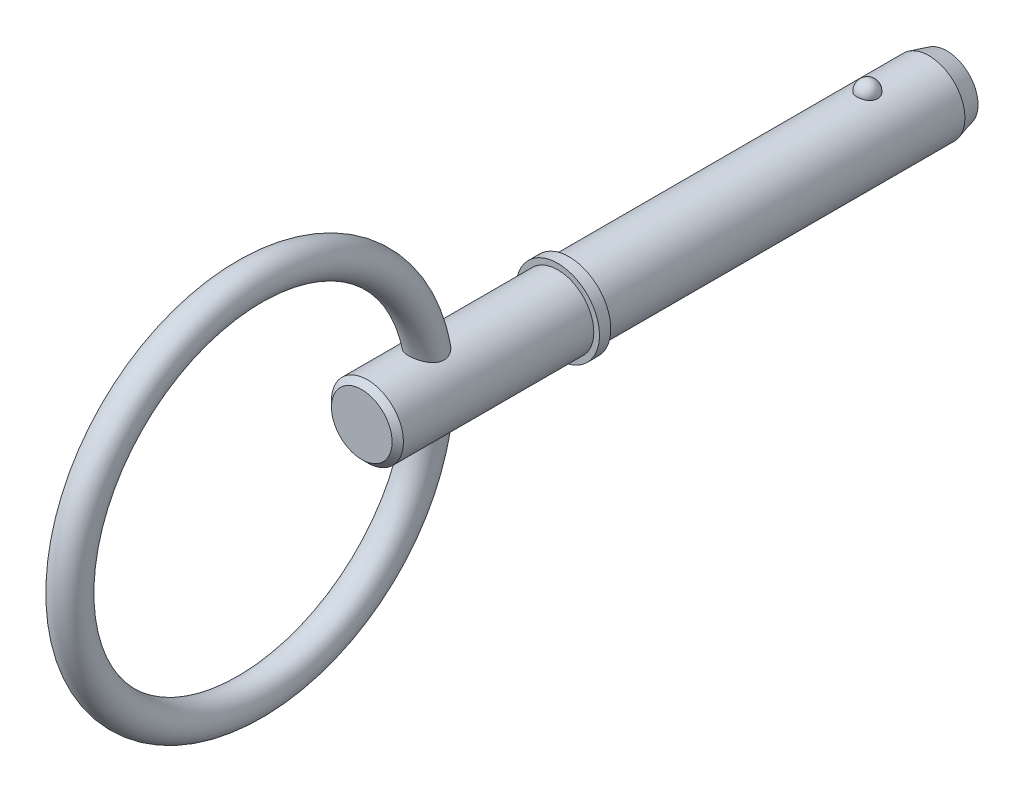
ISO-10303-21;
HEADER;
FILE_DESCRIPTION(('STEP AP214'),'2;1');
FILE_NAME('part.step','',(''),(''),'','','');
FILE_SCHEMA(('AUTOMOTIVE_DESIGN { 1 0 10303 214 1 1 1 1 }'));
ENDSEC;
DATA;
#1=APPLICATION_CONTEXT('core data for automotive mechanical design processes');
#2=APPLICATION_PROTOCOL_DEFINITION('international standard','automotive_design',2000,#1);
#3=PRODUCT_CONTEXT('',#1,'mechanical');
#4=PRODUCT('Part','Part','',(#3));
#5=PRODUCT_RELATED_PRODUCT_CATEGORY('part','',(#4));
#6=PRODUCT_DEFINITION_FORMATION('','',#4);
#7=PRODUCT_DEFINITION_CONTEXT('part definition',#1,'design');
#8=PRODUCT_DEFINITION('design','',#6,#7);
#9=PRODUCT_DEFINITION_SHAPE('','',#8);
#10=(LENGTH_UNIT() NAMED_UNIT(*) SI_UNIT(.MILLI.,.METRE.));
#11=(NAMED_UNIT(*) PLANE_ANGLE_UNIT() SI_UNIT($,.RADIAN.));
#12=(NAMED_UNIT(*) SI_UNIT($,.STERADIAN.) SOLID_ANGLE_UNIT());
#13=UNCERTAINTY_MEASURE_WITH_UNIT(LENGTH_MEASURE(1.E-05),#10,'distance_accuracy_value','');
#14=(GEOMETRIC_REPRESENTATION_CONTEXT(3) GLOBAL_UNCERTAINTY_ASSIGNED_CONTEXT((#13)) GLOBAL_UNIT_ASSIGNED_CONTEXT((#10,
#11,#12)) REPRESENTATION_CONTEXT('',''));
#15=CARTESIAN_POINT('',(0.,0.,0.));
#16=DIRECTION('',(0.,0.,1.));
#17=DIRECTION('',(1.,0.,0.));
#18=AXIS2_PLACEMENT_3D('',#15,#16,#17);
#19=CARTESIAN_POINT('',(0.,0.,25.4));
#20=DIRECTION('',(0.,0.,-1.));
#21=DIRECTION('',(-1.,0.,0.));
#22=AXIS2_PLACEMENT_3D('',#19,#20,#21);
#23=CYLINDRICAL_SURFACE('',#22,3.175);
#24=CARTESIAN_POINT('',(0.90060722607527,3.0445905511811,-0.910000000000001));
#25=CARTESIAN_POINT('',(0.90060646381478,3.04459122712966,-0.859144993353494));
#26=CARTESIAN_POINT('',(0.896466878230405,3.04582460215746,-0.808280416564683));
#27=CARTESIAN_POINT('',(0.88000740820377,3.05062019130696,-0.707994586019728));
#28=CARTESIAN_POINT('',(0.86768478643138,3.05418318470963,-0.658573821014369));
#29=CARTESIAN_POINT('',(0.835170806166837,3.06323316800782,-0.562604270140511));
#30=CARTESIAN_POINT('',(0.814982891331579,3.0687193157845,-0.516054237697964));
#31=CARTESIAN_POINT('',(0.767236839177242,3.08100268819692,-0.427093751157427));
#32=CARTESIAN_POINT('',(0.739678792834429,3.08779989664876,-0.384683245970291));
#33=CARTESIAN_POINT('',(0.677715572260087,3.10198953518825,-0.304951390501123));
#34=CARTESIAN_POINT('',(0.643275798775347,3.10938485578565,-0.267657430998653));
#35=CARTESIAN_POINT('',(0.568522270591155,3.12391647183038,-0.199446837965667));
#36=CARTESIAN_POINT('',(0.528208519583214,3.13105276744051,-0.168530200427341));
#37=CARTESIAN_POINT('',(0.442911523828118,3.14425008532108,-0.114021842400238));
#38=CARTESIAN_POINT('',(0.397942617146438,3.15031426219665,-0.0904084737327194));
#39=CARTESIAN_POINT('',(0.304493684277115,3.16071443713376,-0.051061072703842));
#40=CARTESIAN_POINT('',(0.256014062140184,3.1650506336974,-0.0353261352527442));
#41=CARTESIAN_POINT('',(0.15789136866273,3.17144549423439,-0.0124151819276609));
#42=CARTESIAN_POINT('',(0.108287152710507,3.1735453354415,-0.00508422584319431));
#43=CARTESIAN_POINT('',(0.0085070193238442,3.17538048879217,0.00133254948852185));
#44=CARTESIAN_POINT('',(-0.0416688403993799,3.17511603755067,0.000419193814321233));
#45=CARTESIAN_POINT('',(-0.140377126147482,3.17227395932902,-0.00954840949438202));
#46=CARTESIAN_POINT('',(-0.188922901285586,3.16973088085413,-0.0184810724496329));
#47=CARTESIAN_POINT('',(-0.283780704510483,3.16265029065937,-0.0440659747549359));
#48=CARTESIAN_POINT('',(-0.330092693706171,3.15811274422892,-0.0607183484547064));
#49=CARTESIAN_POINT('',(-0.419493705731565,3.1474895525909,-0.10140675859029));
#50=CARTESIAN_POINT('',(-0.462561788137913,3.14139480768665,-0.125486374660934));
#51=CARTESIAN_POINT('',(-0.54404237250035,3.12831396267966,-0.180346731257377));
#52=CARTESIAN_POINT('',(-0.582454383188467,3.12132776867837,-0.21112817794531));
#53=CARTESIAN_POINT('',(-0.654371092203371,3.10705591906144,-0.279257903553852));
#54=CARTESIAN_POINT('',(-0.687763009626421,3.09976707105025,-0.316724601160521));
#55=CARTESIAN_POINT('',(-0.747869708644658,3.08581767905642,-0.396782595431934));
#56=CARTESIAN_POINT('',(-0.774583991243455,3.07915718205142,-0.43937427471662));
#57=CARTESIAN_POINT('',(-0.820959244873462,3.06712152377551,-0.529074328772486));
#58=CARTESIAN_POINT('',(-0.840531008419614,3.06176288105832,-0.576231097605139));
#59=CARTESIAN_POINT('',(-0.871672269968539,3.0530437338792,-0.673291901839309));
#60=CARTESIAN_POINT('',(-0.883242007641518,3.04968316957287,-0.723195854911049));
#61=CARTESIAN_POINT('',(-0.898057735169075,3.04535343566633,-0.824104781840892));
#62=CARTESIAN_POINT('',(-0.901339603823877,3.04437395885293,-0.875104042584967));
#63=CARTESIAN_POINT('',(-0.89960137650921,3.04488803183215,-0.976947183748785));
#64=CARTESIAN_POINT('',(-0.894581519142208,3.04638151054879,-1.02779106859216));
#65=CARTESIAN_POINT('',(-0.876414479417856,3.051656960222,-1.12760218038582));
#66=CARTESIAN_POINT('',(-0.863310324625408,3.05542681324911,-1.17657789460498));
#67=CARTESIAN_POINT('',(-0.82933491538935,3.06482253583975,-1.27156757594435));
#68=CARTESIAN_POINT('',(-0.808463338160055,3.07044848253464,-1.31758141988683));
#69=CARTESIAN_POINT('',(-0.759325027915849,3.08296842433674,-1.40563218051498));
#70=CARTESIAN_POINT('',(-0.731017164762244,3.08986940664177,-1.44764515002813));
#71=CARTESIAN_POINT('',(-0.667767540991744,3.10415201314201,-1.52624913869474));
#72=CARTESIAN_POINT('',(-0.632825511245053,3.11153365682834,-1.56283993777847));
#73=CARTESIAN_POINT('',(-0.557049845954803,3.12598962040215,-1.62972906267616));
#74=CARTESIAN_POINT('',(-0.516193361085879,3.13306260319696,-1.66000181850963));
#75=CARTESIAN_POINT('',(-0.42979268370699,3.14607829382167,-1.7132172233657));
#76=CARTESIAN_POINT('',(-0.384248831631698,3.15202108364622,-1.73616040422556));
#77=CARTESIAN_POINT('',(-0.290370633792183,3.16204171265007,-1.77380927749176));
#78=CARTESIAN_POINT('',(-0.242079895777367,3.16614263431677,-1.7886174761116));
#79=CARTESIAN_POINT('',(-0.14357928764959,3.17213528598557,-1.81001390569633));
#80=CARTESIAN_POINT('',(-0.0933696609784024,3.1740272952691,-1.81660317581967));
#81=CARTESIAN_POINT('',(0.00648182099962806,3.17537830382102,-1.82132177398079));
#82=CARTESIAN_POINT('',(0.0561153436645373,3.17488455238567,-1.81961539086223));
#83=CARTESIAN_POINT('',(0.154368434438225,3.1716260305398,-1.80816900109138));
#84=CARTESIAN_POINT('',(0.202988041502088,3.16886134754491,-1.79842930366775));
#85=CARTESIAN_POINT('',(0.29764238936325,3.16137318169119,-1.77125024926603));
#86=CARTESIAN_POINT('',(0.343686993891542,3.15665785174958,-1.75384292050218));
#87=CARTESIAN_POINT('',(0.432167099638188,3.14576631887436,-1.71181408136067));
#88=CARTESIAN_POINT('',(0.474602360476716,3.13959001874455,-1.68719209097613));
#89=CARTESIAN_POINT('',(0.555408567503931,3.1263159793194,-1.63094218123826));
#90=CARTESIAN_POINT('',(0.593703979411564,3.11920512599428,-1.59920888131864));
#91=CARTESIAN_POINT('',(0.664472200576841,3.10490064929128,-1.52981493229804));
#92=CARTESIAN_POINT('',(0.696944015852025,3.09770701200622,-1.49215327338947));
#93=CARTESIAN_POINT('',(0.755798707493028,3.08388169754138,-1.41116434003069));
#94=CARTESIAN_POINT('',(0.782059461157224,3.07726269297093,-1.36774610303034));
#95=CARTESIAN_POINT('',(0.827051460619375,3.06547790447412,-1.27699966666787));
#96=CARTESIAN_POINT('',(0.845785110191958,3.06031165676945,-1.22967272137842));
#97=CARTESIAN_POINT('',(0.873798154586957,3.05242388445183,-1.13728658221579));
#98=CARTESIAN_POINT('',(0.883833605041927,3.04951005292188,-1.09247132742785));
#99=CARTESIAN_POINT('',(0.897238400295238,3.0455931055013,-1.00177329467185));
#100=CARTESIAN_POINT('',(0.900607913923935,3.0445899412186,-0.955890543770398));
#101=CARTESIAN_POINT('',(0.90060722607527,3.0445905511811,-0.910000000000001));
#102=B_SPLINE_CURVE_WITH_KNOTS('',3,(#24,#25,#26,#27,#28,#29,#30,#31,#32,#33,#34,#35,#36,#37,
#38,#39,#40,#41,#42,#43,#44,#45,#46,#47,#48,#49,#50,#51,#52,#53,#54,#55,#56,#57,#58,#59,#60,#61,
#62,#63,#64,#65,#66,#67,#68,#69,#70,#71,#72,#73,#74,#75,#76,#77,#78,#79,#80,#81,#82,#83,#84,#85,
#86,#87,#88,#89,#90,#91,#92,#93,#94,#95,#96,#97,#98,#99,#100,#101),.UNSPECIFIED.,.T.,.F.,(4,2,2,
2,2,2,2,2,2,2,2,2,2,2,2,2,2,2,2,2,2,2,2,2,2,2,2,2,2,2,2,2,2,2,2,2,2,2,4),(0.,0.152400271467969,
0.304851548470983,0.45723615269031,0.609618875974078,0.762787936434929,0.915956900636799,
1.06866739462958,1.22136034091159,1.37119044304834,1.52100555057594,1.66858689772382,
1.81617081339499,1.9646377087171,2.1131202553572,2.26455561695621,2.41600229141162,
2.5692805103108,2.72255413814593,2.87516308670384,3.02776764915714,3.1795669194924,
3.33137249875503,3.48403607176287,3.63670583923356,3.78998198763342,3.94324701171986,
4.09453370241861,4.24580126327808,4.39408543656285,4.5423639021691,4.69002878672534,
4.83770349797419,4.9877312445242,5.13778457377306,5.29058018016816,5.44332695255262,
5.58085340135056,5.71837636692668),.UNSPECIFIED.);
#103=CARTESIAN_POINT('',(0.90060722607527,3.0445905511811,-0.910000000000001));
#104=VERTEX_POINT('',#103);
#105=EDGE_CURVE('E102',#104,#104,#102,.T.);
#106=ORIENTED_EDGE('',*,*,#105,.T.);
#107=EDGE_LOOP('',(#106));
#108=FACE_BOUND('',#107,.T.);
#109=CARTESIAN_POINT('',(0.,0.,-6.33399999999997));
#110=DIRECTION('',(0.,0.,-1.));
#111=DIRECTION('',(-1.,0.,0.));
#112=AXIS2_PLACEMENT_3D('',#109,#110,#111);
#113=CIRCLE('',#112,3.175);
#114=CARTESIAN_POINT('',(-3.175,0.,-6.33399999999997));
#115=VERTEX_POINT('',#114);
#116=EDGE_CURVE('E110',#115,#115,#113,.F.);
#117=ORIENTED_EDGE('',*,*,#116,.T.);
#118=EDGE_LOOP('',(#117));
#119=FACE_BOUND('',#118,.T.);
#120=CARTESIAN_POINT('',(0.,0.,25.4));
#121=DIRECTION('',(0.,0.,1.));
#122=DIRECTION('',(1.,0.,0.));
#123=AXIS2_PLACEMENT_3D('',#120,#121,#122);
#124=CIRCLE('',#123,3.175);
#125=CARTESIAN_POINT('',(3.175,0.,25.4));
#126=VERTEX_POINT('',#125);
#127=EDGE_CURVE('E108',#126,#126,#124,.T.);
#128=ORIENTED_EDGE('',*,*,#127,.F.);
#129=EDGE_LOOP('',(#128));
#130=FACE_BOUND('',#129,.T.);
#131=ADVANCED_FACE('F39',(#108,#119,#130),#23,.T.);
#132=CARTESIAN_POINT('',(0.,0.,-7.92));
#133=DIRECTION('',(0.,0.,-1.));
#134=DIRECTION('',(-1.,0.,0.));
#135=AXIS2_PLACEMENT_3D('',#132,#133,#134);
#136=PLANE('',#135);
#137=CARTESIAN_POINT('',(0.,0.,-7.92));
#138=DIRECTION('',(0.,0.,-1.));
#139=DIRECTION('',(-1.,0.,0.));
#140=AXIS2_PLACEMENT_3D('',#137,#138,#139);
#141=CIRCLE('',#140,2.75003258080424);
#142=CARTESIAN_POINT('',(-2.75003258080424,0.,-7.92));
#143=VERTEX_POINT('',#142);
#144=EDGE_CURVE('E142',#143,#143,#141,.T.);
#145=ORIENTED_EDGE('',*,*,#144,.T.);
#146=EDGE_LOOP('',(#145));
#147=FACE_BOUND('',#146,.T.);
#148=ADVANCED_FACE('F88',(#147),#136,.T.);
#149=CARTESIAN_POINT('',(0.,0.,-7.92));
#150=DIRECTION('',(0.,0.,1.));
#151=DIRECTION('',(1.,0.,0.));
#152=AXIS2_PLACEMENT_3D('',#149,#150,#151);
#153=CONICAL_SURFACE('',#152,2.75003258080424,0.261799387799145);
#154=ORIENTED_EDGE('',*,*,#116,.F.);
#155=EDGE_LOOP('',(#154));
#156=FACE_BOUND('',#155,.T.);
#157=ORIENTED_EDGE('',*,*,#144,.F.);
#158=EDGE_LOOP('',(#157));
#159=FACE_BOUND('',#158,.T.);
#160=ADVANCED_FACE('F94',(#156,#159),#153,.T.);
#161=CARTESIAN_POINT('',(0.,3.175,-0.910000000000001));
#162=DIRECTION('',(0.,1.,0.));
#163=DIRECTION('',(0.,0.,-1.));
#164=AXIS2_PLACEMENT_3D('',#161,#162,#163);
#165=SPHERICAL_SURFACE('',#164,0.91);
#166=ORIENTED_EDGE('',*,*,#105,.F.);
#167=EDGE_LOOP('',(#166));
#168=FACE_BOUND('',#167,.T.);
#169=ADVANCED_FACE('F113',(#168),#165,.T.);
#170=CARTESIAN_POINT('',(0.,0.,25.4));
#171=DIRECTION('',(0.,0.,-1.));
#172=DIRECTION('',(-1.,0.,0.));
#173=AXIS2_PLACEMENT_3D('',#170,#171,#172);
#174=PLANE('',#173);
#175=ORIENTED_EDGE('',*,*,#127,.T.);
#176=EDGE_LOOP('',(#175));
#177=FACE_BOUND('',#176,.T.);
#178=CARTESIAN_POINT('',(0.,0.,25.4));
#179=DIRECTION('',(0.,0.,-1.));
#180=DIRECTION('',(-1.,0.,0.));
#181=AXIS2_PLACEMENT_3D('',#178,#179,#180);
#182=CIRCLE('',#181,3.675);
#183=CARTESIAN_POINT('',(-3.675,0.,25.4));
#184=VERTEX_POINT('',#183);
#185=EDGE_CURVE('E109',#184,#184,#182,.T.);
#186=ORIENTED_EDGE('',*,*,#185,.T.);
#187=EDGE_LOOP('',(#186));
#188=FACE_BOUND('',#187,.T.);
#189=ADVANCED_FACE('F117',(#177,#188),#174,.T.);
#190=CARTESIAN_POINT('',(0.,0.,33.7287874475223));
#191=DIRECTION('',(0.,0.,-1.));
#192=DIRECTION('',(-1.,0.,0.));
#193=AXIS2_PLACEMENT_3D('',#190,#191,#192);
#194=CYLINDRICAL_SURFACE('',#193,3.675);
#195=CARTESIAN_POINT('',(0.,0.,26.4));
#196=DIRECTION('',(0.,0.,-1.));
#197=DIRECTION('',(-1.,0.,0.));
#198=AXIS2_PLACEMENT_3D('',#195,#196,#197);
#199=CIRCLE('',#198,3.675);
#200=CARTESIAN_POINT('',(-3.675,0.,26.4));
#201=VERTEX_POINT('',#200);
#202=EDGE_CURVE('E134',#201,#201,#199,.T.);
#203=ORIENTED_EDGE('',*,*,#202,.T.);
#204=EDGE_LOOP('',(#203));
#205=FACE_BOUND('',#204,.T.);
#206=ORIENTED_EDGE('',*,*,#185,.F.);
#207=EDGE_LOOP('',(#206));
#208=FACE_BOUND('',#207,.T.);
#209=ADVANCED_FACE('F121',(#205,#208),#194,.T.);
#210=CARTESIAN_POINT('',(0.,3.675,26.4));
#211=DIRECTION('',(0.,0.,1.));
#212=DIRECTION('',(1.,0.,0.));
#213=AXIS2_PLACEMENT_3D('',#210,#211,#212);
#214=PLANE('',#213);
#215=CARTESIAN_POINT('',(0.,0.,26.4));
#216=DIRECTION('',(0.,0.,1.));
#217=DIRECTION('',(1.,0.,0.));
#218=AXIS2_PLACEMENT_3D('',#215,#216,#217);
#219=CIRCLE('',#218,3.175);
#220=CARTESIAN_POINT('',(3.175,0.,26.4));
#221=VERTEX_POINT('',#220);
#222=EDGE_CURVE('E112',#221,#221,#219,.T.);
#223=ORIENTED_EDGE('',*,*,#222,.F.);
#224=EDGE_LOOP('',(#223));
#225=FACE_BOUND('',#224,.T.);
#226=ORIENTED_EDGE('',*,*,#202,.F.);
#227=EDGE_LOOP('',(#226));
#228=FACE_BOUND('',#227,.T.);
#229=ADVANCED_FACE('F85',(#225,#228),#214,.T.);
#230=CARTESIAN_POINT('',(0.,0.,43.69));
#231=DIRECTION('',(0.,0.,-1.));
#232=DIRECTION('',(-1.,0.,0.));
#233=AXIS2_PLACEMENT_3D('',#230,#231,#232);
#234=CYLINDRICAL_SURFACE('',#233,3.175);
#235=CARTESIAN_POINT('',(-0.793622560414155,-3.07421343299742,36.6949618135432));
#236=CARTESIAN_POINT('',(-0.723928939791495,-3.09220199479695,36.6540743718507));
#237=CARTESIAN_POINT('',(-0.650537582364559,-3.10860299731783,36.6186572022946));
#238=CARTESIAN_POINT('',(-0.49822561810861,-3.13662262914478,36.55960803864));
#239=CARTESIAN_POINT('',(-0.419299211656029,-3.14823615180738,36.535988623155));
#240=CARTESIAN_POINT('',(-0.258022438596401,-3.16553731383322,36.5011787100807));
#241=CARTESIAN_POINT('',(-0.175668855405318,-3.17121924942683,36.4900001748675));
#242=CARTESIAN_POINT('',(-0.0100583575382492,-3.17606405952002,36.4804538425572));
#243=CARTESIAN_POINT('',(0.073198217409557,-3.17522930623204,36.4820813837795));
#244=CARTESIAN_POINT('',(0.236345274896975,-3.16722178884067,36.4979075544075));
#245=CARTESIAN_POINT('',(0.31626956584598,-3.16018772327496,36.5118310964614));
#246=CARTESIAN_POINT('',(0.472429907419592,-3.14064183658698,36.5514871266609));
#247=CARTESIAN_POINT('',(0.548665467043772,-3.12812928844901,36.5772211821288));
#248=CARTESIAN_POINT('',(0.696533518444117,-3.0985857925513,36.6403145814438));
#249=CARTESIAN_POINT('',(0.768085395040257,-3.08149328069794,36.6778336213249));
#250=CARTESIAN_POINT('',(0.903666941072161,-3.04449595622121,36.763584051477));
#251=CARTESIAN_POINT('',(0.967693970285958,-3.02459016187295,36.8118191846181));
#252=CARTESIAN_POINT('',(1.08889306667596,-2.98315111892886,36.920085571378));
#253=CARTESIAN_POINT('',(1.14572430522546,-2.96158491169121,36.9804869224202));
#254=CARTESIAN_POINT('',(1.24806454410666,-2.91993487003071,37.1106874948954));
#255=CARTESIAN_POINT('',(1.29357550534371,-2.89985077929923,37.1804850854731));
#256=CARTESIAN_POINT('',(1.37094214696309,-2.86407549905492,37.3262600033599));
#257=CARTESIAN_POINT('',(1.40307792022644,-2.84829687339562,37.4020662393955));
#258=CARTESIAN_POINT('',(1.45397574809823,-2.82265933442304,37.5589553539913));
#259=CARTESIAN_POINT('',(1.47274938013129,-2.81279529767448,37.6400335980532));
#260=CARTESIAN_POINT('',(1.49549698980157,-2.80076108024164,37.7979026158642));
#261=CARTESIAN_POINT('',(1.50056337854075,-2.79802369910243,37.8744958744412));
#262=CARTESIAN_POINT('',(1.49933665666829,-2.79868066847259,38.0275541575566));
#263=CARTESIAN_POINT('',(1.49304097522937,-2.80207640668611,38.1040191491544));
#264=CARTESIAN_POINT('',(1.46976618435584,-2.81435249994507,38.2552802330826));
#265=CARTESIAN_POINT('',(1.45272287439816,-2.82326580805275,38.3300634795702));
#266=CARTESIAN_POINT('',(1.40884990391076,-2.84541139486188,38.4760088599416));
#267=CARTESIAN_POINT('',(1.38201642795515,-2.85864535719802,38.5471695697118));
#268=CARTESIAN_POINT('',(1.31496449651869,-2.89016475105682,38.6946079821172));
#269=CARTESIAN_POINT('',(1.27338339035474,-2.90890132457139,38.7701693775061));
#270=CARTESIAN_POINT('',(1.17952729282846,-2.94820796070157,38.9139034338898));
#271=CARTESIAN_POINT('',(1.12723913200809,-2.96878026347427,38.9820668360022));
#272=CARTESIAN_POINT('',(1.0057072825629,-3.01228109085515,39.1173106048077));
#273=CARTESIAN_POINT('',(0.93517459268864,-3.03519170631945,39.1832498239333));
#274=CARTESIAN_POINT('',(0.782605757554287,-3.07805054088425,39.301321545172));
#275=CARTESIAN_POINT('',(0.700588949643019,-3.09800362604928,39.3534768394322));
#276=CARTESIAN_POINT('',(0.549003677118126,-3.12787153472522,39.4296423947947));
#277=CARTESIAN_POINT('',(0.481582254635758,-3.1390487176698,39.4574376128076));
#278=CARTESIAN_POINT('',(0.34269622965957,-3.15722518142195,39.5021563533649));
#279=CARTESIAN_POINT('',(0.271235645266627,-3.16422853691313,39.5190904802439));
#280=CARTESIAN_POINT('',(0.125873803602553,-3.17334230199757,39.5410622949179));
#281=CARTESIAN_POINT('',(0.0519637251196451,-3.17543249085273,39.5460508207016));
#282=CARTESIAN_POINT('',(-0.0956207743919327,-3.17441743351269,39.5436180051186));
#283=CARTESIAN_POINT('',(-0.16929518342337,-3.1713119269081,39.5361960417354));
#284=CARTESIAN_POINT('',(-0.309449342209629,-3.1606169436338,39.5103375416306));
#285=CARTESIAN_POINT('',(-0.376089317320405,-3.15332372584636,39.4926279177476));
#286=CARTESIAN_POINT('',(-0.505583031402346,-3.13517004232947,39.4477876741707));
#287=CARTESIAN_POINT('',(-0.568435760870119,-3.12430863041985,39.4206545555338));
#288=CARTESIAN_POINT('',(-0.694306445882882,-3.09887452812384,39.3555626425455));
#289=CARTESIAN_POINT('',(-0.756907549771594,-3.08406907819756,39.3168937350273));
#290=CARTESIAN_POINT('',(-0.875645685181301,-3.05248288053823,39.2313455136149));
#291=CARTESIAN_POINT('',(-0.931779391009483,-3.03570112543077,39.1844620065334));
#292=CARTESIAN_POINT('',(-1.0463923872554,-2.99832170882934,39.0747926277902));
#293=CARTESIAN_POINT('',(-1.10353654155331,-2.97757338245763,39.0106605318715));
#294=CARTESIAN_POINT('',(-1.20755858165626,-2.93692907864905,38.8742268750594));
#295=CARTESIAN_POINT('',(-1.25442453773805,-2.91703411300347,38.8019159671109));
#296=CARTESIAN_POINT('',(-1.34199791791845,-2.87788786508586,38.6412794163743));
#297=CARTESIAN_POINT('',(-1.38127718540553,-2.8590047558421,38.5520744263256));
#298=CARTESIAN_POINT('',(-1.44406659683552,-2.82781619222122,38.3671839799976));
#299=CARTESIAN_POINT('',(-1.46759319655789,-2.81550387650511,38.2715054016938));
#300=CARTESIAN_POINT('',(-1.49571801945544,-2.8006591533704,38.0845771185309));
#301=CARTESIAN_POINT('',(-1.50169726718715,-2.79741422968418,37.993598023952));
#302=CARTESIAN_POINT('',(-1.49747735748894,-2.79967890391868,37.8121564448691));
#303=CARTESIAN_POINT('',(-1.48729863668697,-2.80517744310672,37.7216934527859));
#304=CARTESIAN_POINT('',(-1.45348639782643,-2.82281521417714,37.5584626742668));
#305=CARTESIAN_POINT('',(-1.43212237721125,-2.83382344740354,37.485088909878));
#306=CARTESIAN_POINT('',(-1.37828411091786,-2.86039426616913,37.3433903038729));
#307=CARTESIAN_POINT('',(-1.34580440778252,-2.87595908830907,37.2750679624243));
#308=CARTESIAN_POINT('',(-1.27066760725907,-2.90993532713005,37.1450336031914));
#309=CARTESIAN_POINT('',(-1.22800357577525,-2.92834868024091,37.083326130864));
#310=CARTESIAN_POINT('',(-1.13363307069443,-2.96615489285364,36.9677083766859));
#311=CARTESIAN_POINT('',(-1.08193541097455,-2.98554678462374,36.9137905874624));
#312=CARTESIAN_POINT('',(-0.990573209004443,-3.01675653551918,36.8323094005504));
#313=CARTESIAN_POINT('',(-0.953209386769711,-3.02880489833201,36.8022130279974));
#314=CARTESIAN_POINT('',(-0.875544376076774,-3.0521621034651,36.7457477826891));
#315=CARTESIAN_POINT('',(-0.835242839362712,-3.06347085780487,36.7193793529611));
#316=CARTESIAN_POINT('',(-0.793622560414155,-3.07421343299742,36.6949618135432));
#317=B_SPLINE_CURVE_WITH_KNOTS('',3,(#235,#236,#237,#238,#239,#240,#241,#242,#243,#244,#245,
#246,#247,#248,#249,#250,#251,#252,#253,#254,#255,#256,#257,#258,#259,#260,#261,#262,#263,#264,
#265,#266,#267,#268,#269,#270,#271,#272,#273,#274,#275,#276,#277,#278,#279,#280,#281,#282,#283,
#284,#285,#286,#287,#288,#289,#290,#291,#292,#293,#294,#295,#296,#297,#298,#299,#300,#301,#302,
#303,#304,#305,#306,#307,#308,#309,#310,#311,#312,#313,#314,#315,#316),.UNSPECIFIED.,.T.,.F.,(4,
2,2,2,2,2,2,2,2,2,2,2,2,2,2,2,2,2,2,2,2,2,2,2,2,2,2,2,2,2,2,2,2,2,2,2,2,2,2,2,4),(0.,
0.248167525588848,0.496599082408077,0.745269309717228,0.993849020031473,1.23700449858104,
1.48019225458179,1.72682894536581,1.97355191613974,2.22939388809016,2.48519151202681,
2.73532416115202,2.98523982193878,3.21455414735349,3.44392036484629,3.67466984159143,
3.90550934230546,4.16925064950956,4.43331832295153,4.7295197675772,5.0252283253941,
5.24564983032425,5.46585579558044,5.68696647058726,5.9080882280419,6.11521387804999,
6.32239449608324,6.54672206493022,6.77116447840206,7.03522663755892,7.29959368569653,
7.59590092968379,7.89189815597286,8.16387683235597,8.43551178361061,8.66603557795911,
8.89667271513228,9.12746733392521,9.35803801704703,9.50622339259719,9.6544263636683),.UNSPECIFIED.);
#318=CARTESIAN_POINT('',(-0.793622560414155,-3.07421343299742,36.6949618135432));
#319=VERTEX_POINT('',#318);
#320=EDGE_CURVE('E10',#319,#319,#317,.T.);
#321=ORIENTED_EDGE('',*,*,#320,.F.);
#322=EDGE_LOOP('',(#321));
#323=FACE_BOUND('',#322,.T.);
#324=CARTESIAN_POINT('',(-0.793622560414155,3.07421343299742,36.6949618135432));
#325=CARTESIAN_POINT('',(-0.864606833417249,3.05588589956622,36.7366128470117));
#326=CARTESIAN_POINT('',(-0.931875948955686,3.03587991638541,36.7840114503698));
#327=CARTESIAN_POINT('',(-1.05725170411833,2.99453227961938,36.8893775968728));
#328=CARTESIAN_POINT('',(-1.11534118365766,2.97318822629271,36.9473645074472));
#329=CARTESIAN_POINT('',(-1.22080462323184,2.93146441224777,37.072887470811));
#330=CARTESIAN_POINT('',(-1.26816209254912,2.91108617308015,37.1404379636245));
#331=CARTESIAN_POINT('',(-1.35052787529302,2.87380473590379,37.2835086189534));
#332=CARTESIAN_POINT('',(-1.38554886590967,2.856897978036,37.3590204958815));
#333=CARTESIAN_POINT('',(-1.44074287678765,2.82945202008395,37.5122947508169));
#334=CARTESIAN_POINT('',(-1.46153301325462,2.81865228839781,37.5897872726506));
#335=CARTESIAN_POINT('',(-1.49023441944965,2.80358650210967,37.7477206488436));
#336=CARTESIAN_POINT('',(-1.49815016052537,2.79931817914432,37.8281604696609));
#337=CARTESIAN_POINT('',(-1.50117056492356,2.79769676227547,37.9840076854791));
#338=CARTESIAN_POINT('',(-1.49708260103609,2.79990784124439,38.0593985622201));
#339=CARTESIAN_POINT('',(-1.47846985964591,2.80977909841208,38.2084983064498));
#340=CARTESIAN_POINT('',(-1.46394166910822,2.8174410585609,38.2822066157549));
#341=CARTESIAN_POINT('',(-1.42400377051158,2.83784609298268,38.4313443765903));
#342=CARTESIAN_POINT('',(-1.39791960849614,2.85090002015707,38.5065484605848));
#343=CARTESIAN_POINT('',(-1.33585690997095,2.8805017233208,38.6520384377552));
#344=CARTESIAN_POINT('',(-1.29987052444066,2.89705226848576,38.7223203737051));
#345=CARTESIAN_POINT('',(-1.21229019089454,2.93489412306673,38.8677405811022));
#346=CARTESIAN_POINT('',(-1.15911759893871,2.95651988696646,38.9418449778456));
#347=CARTESIAN_POINT('',(-1.04143166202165,2.99999612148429,39.0803805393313));
#348=CARTESIAN_POINT('',(-0.976918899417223,3.0218465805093,39.144812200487));
#349=CARTESIAN_POINT('',(-0.845368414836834,3.06106710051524,39.2552302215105));
#350=CARTESIAN_POINT('',(-0.779466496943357,3.0786636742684,39.3024840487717));
#351=CARTESIAN_POINT('',(-0.640261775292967,3.11059085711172,39.3859540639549));
#352=CARTESIAN_POINT('',(-0.566963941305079,3.12492363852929,39.4221775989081));
#353=CARTESIAN_POINT('',(-0.413802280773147,3.14887886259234,39.4818109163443));
#354=CARTESIAN_POINT('',(-0.333888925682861,3.15846114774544,39.5051116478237));
#355=CARTESIAN_POINT('',(-0.170660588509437,3.17146222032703,39.5365717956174));
#356=CARTESIAN_POINT('',(-0.0873493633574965,3.17488763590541,39.5447474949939));
#357=CARTESIAN_POINT('',(0.0674621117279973,3.17509166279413,39.5452317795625));
#358=CARTESIAN_POINT('',(0.138963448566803,3.17274321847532,39.5396242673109));
#359=CARTESIAN_POINT('',(0.279855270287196,3.16342998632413,39.5171581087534));
#360=CARTESIAN_POINT('',(0.349245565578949,3.15646478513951,39.5002984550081));
#361=CARTESIAN_POINT('',(0.483013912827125,3.13875920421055,39.4567119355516));
#362=CARTESIAN_POINT('',(0.547455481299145,3.12808257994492,39.4301513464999));
#363=CARTESIAN_POINT('',(0.671431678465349,3.10383639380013,39.3683782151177));
#364=CARTESIAN_POINT('',(0.730964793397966,3.09026594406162,39.3331630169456));
#365=CARTESIAN_POINT('',(0.852308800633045,3.05919023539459,39.2498716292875));
#366=CARTESIAN_POINT('',(0.913284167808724,3.04140021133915,39.2006877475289));
#367=CARTESIAN_POINT('',(1.0273242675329,3.00480015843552,39.0941850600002));
#368=CARTESIAN_POINT('',(1.08038247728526,2.98598930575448,39.0368596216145));
#369=CARTESIAN_POINT('',(1.18657794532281,2.94557646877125,38.9046952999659));
#370=CARTESIAN_POINT('',(1.23812372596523,2.92405810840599,38.8285445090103));
#371=CARTESIAN_POINT('',(1.32862928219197,2.88406370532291,38.6682796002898));
#372=CARTESIAN_POINT('',(1.36758013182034,2.86558982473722,38.5841598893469));
#373=CARTESIAN_POINT('',(1.43274280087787,2.83359383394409,38.4061421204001));
#374=CARTESIAN_POINT('',(1.45837682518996,2.82030175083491,38.3119863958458));
#375=CARTESIAN_POINT('',(1.49241322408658,2.80245006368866,38.1198495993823));
#376=CARTESIAN_POINT('',(1.50084951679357,2.79787327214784,38.0218764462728));
#377=CARTESIAN_POINT('',(1.49914798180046,2.79877932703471,37.8405073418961));
#378=CARTESIAN_POINT('',(1.49154990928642,2.80288682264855,37.757078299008));
#379=CARTESIAN_POINT('',(1.4625313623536,2.81813655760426,37.5933228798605));
#380=CARTESIAN_POINT('',(1.44111368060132,2.82927737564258,37.5129958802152));
#381=CARTESIAN_POINT('',(1.38785163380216,2.85574398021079,37.3657200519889));
#382=CARTESIAN_POINT('',(1.3572264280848,2.87055627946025,37.2982302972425));
#383=CARTESIAN_POINT('',(1.28612163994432,2.90310901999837,37.1694446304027));
#384=CARTESIAN_POINT('',(1.24564038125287,2.92084995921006,37.108149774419));
#385=CARTESIAN_POINT('',(1.1532082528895,2.95860856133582,36.9894756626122));
#386=CARTESIAN_POINT('',(1.10072548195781,2.97869868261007,36.9325343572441));
#387=CARTESIAN_POINT('',(0.987118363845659,3.01825121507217,36.8277702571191));
#388=CARTESIAN_POINT('',(0.925990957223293,3.03771340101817,36.7799507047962));
#389=CARTESIAN_POINT('',(0.792065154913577,3.07545294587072,36.6913571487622));
#390=CARTESIAN_POINT('',(0.718757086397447,3.0935612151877,36.6512781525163));
#391=CARTESIAN_POINT('',(0.565747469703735,3.12516438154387,36.5833730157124));
#392=CARTESIAN_POINT('',(0.486046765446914,3.13865988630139,36.5555452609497));
#393=CARTESIAN_POINT('',(0.323293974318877,3.15955163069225,36.5130890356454));
#394=CARTESIAN_POINT('',(0.240283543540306,3.16700771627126,36.4983309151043));
#395=CARTESIAN_POINT('',(0.0726303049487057,3.17527774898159,36.4819853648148));
#396=CARTESIAN_POINT('',(-0.01201261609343,3.17609123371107,36.4803988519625));
#397=CARTESIAN_POINT('',(-0.177340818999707,3.17108555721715,36.4902649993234));
#398=CARTESIAN_POINT('',(-0.2580610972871,3.16549698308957,36.5012643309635));
#399=CARTESIAN_POINT('',(-0.416230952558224,3.1486007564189,36.5352506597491));
#400=CARTESIAN_POINT('',(-0.493684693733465,3.13730063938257,36.5582218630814));
#401=CARTESIAN_POINT('',(-0.607599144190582,3.11657538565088,36.6018364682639));
#402=CARTESIAN_POINT('',(-0.645999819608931,3.10882447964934,36.6183691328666));
#403=CARTESIAN_POINT('',(-0.721122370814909,3.092262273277,36.6544352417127));
#404=CARTESIAN_POINT('',(-0.757844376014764,3.08345105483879,36.6739684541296));
#405=CARTESIAN_POINT('',(-0.793622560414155,3.07421343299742,36.6949618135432));
#406=B_SPLINE_CURVE_WITH_KNOTS('',3,(#324,#325,#326,#327,#328,#329,#330,#331,#332,#333,#334,
#335,#336,#337,#338,#339,#340,#341,#342,#343,#344,#345,#346,#347,#348,#349,#350,#351,#352,#353,
#354,#355,#356,#357,#358,#359,#360,#361,#362,#363,#364,#365,#366,#367,#368,#369,#370,#371,#372,
#373,#374,#375,#376,#377,#378,#379,#380,#381,#382,#383,#384,#385,#386,#387,#388,#389,#390,#391,
#392,#393,#394,#395,#396,#397,#398,#399,#400,#401,#402,#403,#404,#405),.UNSPECIFIED.,.T.,.F.,(4,
2,2,2,2,2,2,2,2,2,2,2,2,2,2,2,2,2,2,2,2,2,2,2,2,2,2,2,2,2,2,2,2,2,2,2,2,2,2,2,4),(0.,
0.252800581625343,0.506068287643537,0.759722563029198,1.01311541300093,1.25467278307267,
1.49614624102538,1.72175790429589,1.94744335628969,2.18851823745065,2.4297847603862,
2.70981318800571,2.98982723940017,3.23776482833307,3.48553690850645,3.73536921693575,
3.98493240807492,4.19913817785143,4.41336312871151,4.62407643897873,4.83485449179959,
5.07495869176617,5.31525962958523,5.59735778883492,5.87965543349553,6.17335015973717,
6.46646508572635,6.71664398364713,6.96677234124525,7.19253107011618,7.41832822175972,
7.65731660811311,7.8963897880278,8.15162793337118,8.40683243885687,8.65947601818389,
8.91213718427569,9.15597668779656,9.39949531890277,9.5269241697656,9.65434318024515),.UNSPECIFIED.);
#407=CARTESIAN_POINT('',(-0.793622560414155,3.07421343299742,36.6949618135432));
#408=VERTEX_POINT('',#407);
#409=EDGE_CURVE('E51',#408,#408,#406,.T.);
#410=ORIENTED_EDGE('',*,*,#409,.F.);
#411=EDGE_LOOP('',(#410));
#412=FACE_BOUND('',#411,.T.);
#413=CARTESIAN_POINT('',(0.,0.,43.19));
#414=DIRECTION('',(0.,0.,-1.));
#415=DIRECTION('',(-1.,0.,0.));
#416=AXIS2_PLACEMENT_3D('',#413,#414,#415);
#417=CIRCLE('',#416,3.175);
#418=CARTESIAN_POINT('',(-3.175,0.,43.19));
#419=VERTEX_POINT('',#418);
#420=EDGE_CURVE('E64',#419,#419,#417,.T.);
#421=ORIENTED_EDGE('',*,*,#420,.T.);
#422=EDGE_LOOP('',(#421));
#423=FACE_BOUND('',#422,.T.);
#424=ORIENTED_EDGE('',*,*,#222,.T.);
#425=EDGE_LOOP('',(#424));
#426=FACE_BOUND('',#425,.T.);
#427=ADVANCED_FACE('F69',(#323,#412,#423,#426),#234,.T.);
#428=CARTESIAN_POINT('',(0.,0.,43.69));
#429=DIRECTION('',(0.,0.,-1.));
#430=DIRECTION('',(-1.,0.,0.));
#431=AXIS2_PLACEMENT_3D('',#428,#429,#430);
#432=PLANE('',#431);
#433=CARTESIAN_POINT('',(0.,0.,43.69));
#434=DIRECTION('',(0.,0.,-1.));
#435=DIRECTION('',(-1.,0.,0.));
#436=AXIS2_PLACEMENT_3D('',#433,#434,#435);
#437=CIRCLE('',#436,2.675);
#438=CARTESIAN_POINT('',(-2.675,0.,43.69));
#439=VERTEX_POINT('',#438);
#440=EDGE_CURVE('E58',#439,#439,#437,.F.);
#441=ORIENTED_EDGE('',*,*,#440,.T.);
#442=EDGE_LOOP('',(#441));
#443=FACE_BOUND('',#442,.T.);
#444=ADVANCED_FACE('F76',(#443),#432,.F.);
#445=CARTESIAN_POINT('',(0.,0.,43.19));
#446=DIRECTION('',(0.,0.,-1.));
#447=DIRECTION('',(-1.,0.,0.));
#448=AXIS2_PLACEMENT_3D('',#445,#446,#447);
#449=CONICAL_SURFACE('',#448,3.175,0.785398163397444);
#450=ORIENTED_EDGE('',*,*,#440,.F.);
#451=EDGE_LOOP('',(#450));
#452=FACE_BOUND('',#451,.T.);
#453=ORIENTED_EDGE('',*,*,#420,.F.);
#454=EDGE_LOOP('',(#453));
#455=FACE_BOUND('',#454,.T.);
#456=ADVANCED_FACE('F41',(#452,#455),#449,.T.);
#457=CARTESIAN_POINT('',(0.,0.,53.565));
#458=DIRECTION('',(1.,0.,0.));
#459=DIRECTION('',(0.,0.,-1.));
#460=AXIS2_PLACEMENT_3D('',#457,#458,#459);
#461=TOROIDAL_SURFACE('',#460,15.875,1.5);
#462=ORIENTED_EDGE('',*,*,#320,.T.);
#463=EDGE_LOOP('',(#462));
#464=FACE_BOUND('',#463,.T.);
#465=ORIENTED_EDGE('',*,*,#409,.T.);
#466=EDGE_LOOP('',(#465));
#467=FACE_BOUND('',#466,.T.);
#468=ADVANCED_FACE('F73',(#464,#467),#461,.T.);
#469=CLOSED_SHELL('',(#131,#148,#160,#169,#189,#209,#229,#427,#444,#456,#468));
#470=MANIFOLD_SOLID_BREP('B2',#469);
#471=ADVANCED_BREP_SHAPE_REPRESENTATION('',(#18,#470),#14);
#472=SHAPE_DEFINITION_REPRESENTATION(#9,#471);
ENDSEC;
END-ISO-10303-21;
